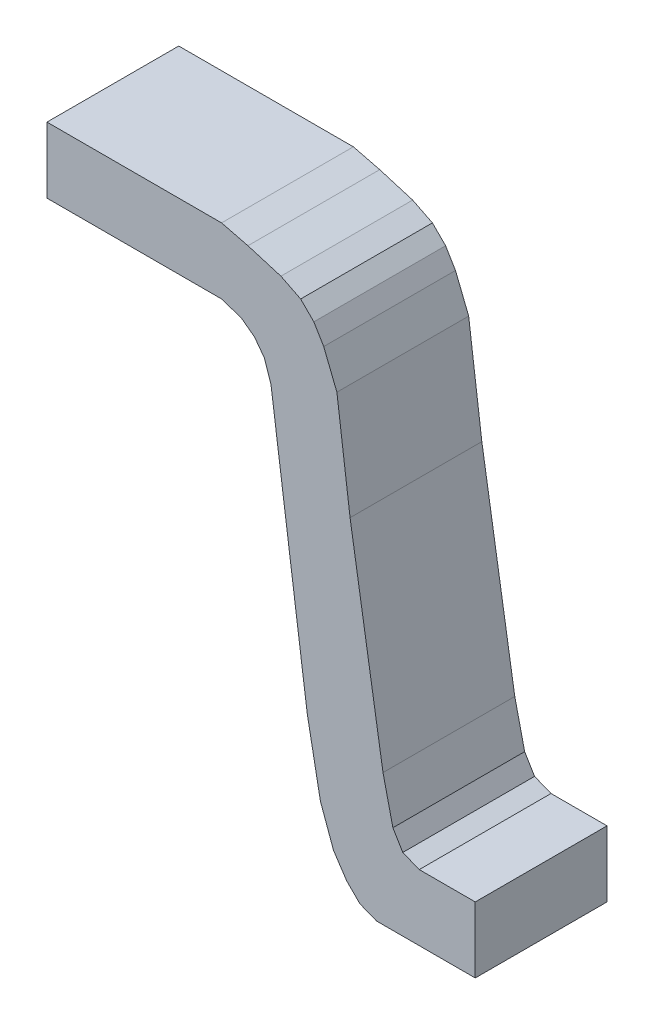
ISO-10303-21;
HEADER;
FILE_DESCRIPTION(('STEP AP214'),'2;1');
FILE_NAME('part.step','',(''),(''),'','','');
FILE_SCHEMA(('AUTOMOTIVE_DESIGN { 1 0 10303 214 1 1 1 1 }'));
ENDSEC;
DATA;
#1=APPLICATION_CONTEXT('core data for automotive mechanical design processes');
#2=APPLICATION_PROTOCOL_DEFINITION('international standard','automotive_design',2000,#1);
#3=PRODUCT_CONTEXT('',#1,'mechanical');
#4=PRODUCT('Part','Part','',(#3));
#5=PRODUCT_RELATED_PRODUCT_CATEGORY('part','',(#4));
#6=PRODUCT_DEFINITION_FORMATION('','',#4);
#7=PRODUCT_DEFINITION_CONTEXT('part definition',#1,'design');
#8=PRODUCT_DEFINITION('design','',#6,#7);
#9=PRODUCT_DEFINITION_SHAPE('','',#8);
#10=(LENGTH_UNIT() NAMED_UNIT(*) SI_UNIT(.MILLI.,.METRE.));
#11=(NAMED_UNIT(*) PLANE_ANGLE_UNIT() SI_UNIT($,.RADIAN.));
#12=(NAMED_UNIT(*) SI_UNIT($,.STERADIAN.) SOLID_ANGLE_UNIT());
#13=UNCERTAINTY_MEASURE_WITH_UNIT(LENGTH_MEASURE(1.E-05),#10,'distance_accuracy_value','');
#14=(GEOMETRIC_REPRESENTATION_CONTEXT(3) GLOBAL_UNCERTAINTY_ASSIGNED_CONTEXT((#13)) GLOBAL_UNIT_ASSIGNED_CONTEXT((#10,
#11,#12)) REPRESENTATION_CONTEXT('',''));
#15=CARTESIAN_POINT('',(0.,0.,0.));
#16=DIRECTION('',(0.,0.,1.));
#17=DIRECTION('',(1.,0.,0.));
#18=AXIS2_PLACEMENT_3D('',#15,#16,#17);
#19=CARTESIAN_POINT('',(0.65000124,-0.7999984,0.4));
#20=DIRECTION('',(0.,0.,1.));
#21=DIRECTION('',(1.,0.,0.));
#22=AXIS2_PLACEMENT_3D('',#19,#20,#21);
#23=PLANE('',#22);
#24=DIRECTION('',(0.928476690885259,-0.371390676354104,0.));
#25=VECTOR('',#24,1.);
#26=CARTESIAN_POINT('',(0.35000184,-0.7999984,0.4));
#27=LINE('',#26,#25);
#28=CARTESIAN_POINT('',(0.35000184,-0.7999984,0.4));
#29=VERTEX_POINT('',#28);
#30=CARTESIAN_POINT('',(0.30000194,-0.77999844,0.4));
#31=VERTEX_POINT('',#30);
#32=EDGE_CURVE('E307',#29,#31,#27,.F.);
#33=ORIENTED_EDGE('',*,*,#32,.F.);
#34=DIRECTION('',(1.,0.,0.));
#35=VECTOR('',#34,1.);
#36=CARTESIAN_POINT('',(0.65000124,-0.7999984,0.4));
#37=LINE('',#36,#35);
#38=CARTESIAN_POINT('',(0.65000124,-0.7999984,0.4));
#39=VERTEX_POINT('',#38);
#40=EDGE_CURVE('E208',#39,#29,#37,.F.);
#41=ORIENTED_EDGE('',*,*,#40,.F.);
#42=DIRECTION('',(0.,1.,0.));
#43=VECTOR('',#42,1.);
#44=CARTESIAN_POINT('',(0.65000124,-0.5999988,0.4));
#45=LINE('',#44,#43);
#46=CARTESIAN_POINT('',(0.65000124,-0.5999988,0.4));
#47=VERTEX_POINT('',#46);
#48=EDGE_CURVE('E20',#47,#39,#45,.F.);
#49=ORIENTED_EDGE('',*,*,#48,.F.);
#50=DIRECTION('',(1.,0.,0.));
#51=VECTOR('',#50,1.);
#52=CARTESIAN_POINT('',(0.48000158,-0.5999988,0.4));
#53=LINE('',#52,#51);
#54=CARTESIAN_POINT('',(0.48000158,-0.5999988,0.4));
#55=VERTEX_POINT('',#54);
#56=EDGE_CURVE('E197',#55,#47,#53,.T.);
#57=ORIENTED_EDGE('',*,*,#56,.F.);
#58=DIRECTION('',(-0.928476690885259,0.371390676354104,0.));
#59=VECTOR('',#58,1.);
#60=CARTESIAN_POINT('',(0.43000168,-0.57999884,0.4));
#61=LINE('',#60,#59);
#62=CARTESIAN_POINT('',(0.430001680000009,-0.579998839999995,0.4));
#63=VERTEX_POINT('',#62);
#64=EDGE_CURVE('E192',#63,#55,#61,.F.);
#65=ORIENTED_EDGE('',*,*,#64,.F.);
#66=DIRECTION('',(-0.514495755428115,0.857492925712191,0.));
#67=VECTOR('',#66,1.);
#68=CARTESIAN_POINT('',(0.40000174,-0.52999894,0.4));
#69=LINE('',#68,#67);
#70=CARTESIAN_POINT('',(0.400001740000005,-0.529998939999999,0.4));
#71=VERTEX_POINT('',#70);
#72=EDGE_CURVE('E219',#71,#63,#69,.F.);
#73=ORIENTED_EDGE('',*,*,#72,.F.);
#74=DIRECTION('',(-0.224859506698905,0.974391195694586,0.));
#75=VECTOR('',#74,1.);
#76=CARTESIAN_POINT('',(0.3700018,-0.3999992,0.4));
#77=LINE('',#76,#75);
#78=CARTESIAN_POINT('',(0.37000180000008,-0.399999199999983,0.4));
#79=VERTEX_POINT('',#78);
#80=EDGE_CURVE('E223',#79,#71,#77,.F.);
#81=ORIENTED_EDGE('',*,*,#80,.F.);
#82=DIRECTION('',(-0.159231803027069,0.987241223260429,0.));
#83=VECTOR('',#82,1.);
#84=CARTESIAN_POINT('',(0.270002,0.2200021,0.4));
#85=LINE('',#84,#83);
#86=CARTESIAN_POINT('',(0.270001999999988,0.220002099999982,0.4));
#87=VERTEX_POINT('',#86);
#88=EDGE_CURVE('E227',#87,#79,#85,.F.);
#89=ORIENTED_EDGE('',*,*,#88,.F.);
#90=DIRECTION('',(-0.127971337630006,0.99177786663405,0.));
#91=VECTOR('',#90,1.);
#92=CARTESIAN_POINT('',(0.23000208,0.53000148,0.4));
#93=LINE('',#92,#91);
#94=CARTESIAN_POINT('',(0.23000208,0.53000148,0.4));
#95=VERTEX_POINT('',#94);
#96=EDGE_CURVE('E231',#95,#87,#93,.F.);
#97=ORIENTED_EDGE('',*,*,#96,.F.);
#98=DIRECTION('',(-0.371390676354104,0.928476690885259,0.));
#99=VECTOR('',#98,1.);
#100=CARTESIAN_POINT('',(0.19000216,0.63000128,0.4));
#101=LINE('',#100,#99);
#102=CARTESIAN_POINT('',(0.190002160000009,0.630001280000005,0.4));
#103=VERTEX_POINT('',#102);
#104=EDGE_CURVE('E235',#103,#95,#101,.F.);
#105=ORIENTED_EDGE('',*,*,#104,.F.);
#106=DIRECTION('',(-0.514495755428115,0.857492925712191,0.));
#107=VECTOR('',#106,1.);
#108=CARTESIAN_POINT('',(0.16000222,0.68000118,0.4));
#109=LINE('',#108,#107);
#110=CARTESIAN_POINT('',(0.16000222,0.68000118,0.4));
#111=VERTEX_POINT('',#110);
#112=EDGE_CURVE('E239',#111,#103,#109,.F.);
#113=ORIENTED_EDGE('',*,*,#112,.F.);
#114=DIRECTION('',(-0.707106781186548,0.707106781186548,0.));
#115=VECTOR('',#114,1.);
#116=CARTESIAN_POINT('',(0.1200023,0.7200011,0.4));
#117=LINE('',#116,#115);
#118=CARTESIAN_POINT('',(0.1200023,0.7200011,0.4));
#119=VERTEX_POINT('',#118);
#120=EDGE_CURVE('E243',#119,#111,#117,.F.);
#121=ORIENTED_EDGE('',*,*,#120,.F.);
#122=DIRECTION('',(-0.894427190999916,0.447213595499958,0.));
#123=VECTOR('',#122,1.);
#124=CARTESIAN_POINT('',(0.06000242,0.75000104,0.4));
#125=LINE('',#124,#123);
#126=CARTESIAN_POINT('',(0.0600024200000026,0.750001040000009,0.4));
#127=VERTEX_POINT('',#126);
#128=EDGE_CURVE('E247',#127,#119,#125,.F.);
#129=ORIENTED_EDGE('',*,*,#128,.F.);
#130=DIRECTION('',(-0.957828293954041,0.287341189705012,0.));
#131=VECTOR('',#130,1.);
#132=CARTESIAN_POINT('',(-0.03999992,0.78000098,0.4));
#133=LINE('',#132,#131);
#134=CARTESIAN_POINT('',(-0.0399999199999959,0.780000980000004,0.4));
#135=VERTEX_POINT('',#134);
#136=EDGE_CURVE('E251',#135,#127,#133,.F.);
#137=ORIENTED_EDGE('',*,*,#136,.F.);
#138=DIRECTION('',(-0.970142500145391,0.242535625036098,0.));
#139=VECTOR('',#138,1.);
#140=CARTESIAN_POINT('',(-0.11999976,0.80000094,0.4));
#141=LINE('',#140,#139);
#142=CARTESIAN_POINT('',(-0.11999976,0.80000094,0.4));
#143=VERTEX_POINT('',#142);
#144=EDGE_CURVE('E255',#143,#135,#141,.F.);
#145=ORIENTED_EDGE('',*,*,#144,.F.);
#146=DIRECTION('',(1.,0.,0.));
#147=VECTOR('',#146,1.);
#148=CARTESIAN_POINT('',(-0.6499987,0.80000094,0.4));
#149=LINE('',#148,#147);
#150=CARTESIAN_POINT('',(-0.6499987,0.80000094,0.4));
#151=VERTEX_POINT('',#150);
#152=EDGE_CURVE('E259',#151,#143,#149,.T.);
#153=ORIENTED_EDGE('',*,*,#152,.F.);
#154=DIRECTION('',(0.,1.,0.));
#155=VECTOR('',#154,1.);
#156=CARTESIAN_POINT('',(-0.6499987,0.60000134,0.4));
#157=LINE('',#156,#155);
#158=CARTESIAN_POINT('',(-0.6499987,0.60000134,0.4));
#159=VERTEX_POINT('',#158);
#160=EDGE_CURVE('E263',#159,#151,#157,.T.);
#161=ORIENTED_EDGE('',*,*,#160,.F.);
#162=DIRECTION('',(1.,0.,0.));
#163=VECTOR('',#162,1.);
#164=CARTESIAN_POINT('',(-0.11999976,0.60000134,0.4));
#165=LINE('',#164,#163);
#166=CARTESIAN_POINT('',(-0.11999976,0.60000134,0.4));
#167=VERTEX_POINT('',#166);
#168=EDGE_CURVE('E267',#167,#159,#165,.F.);
#169=ORIENTED_EDGE('',*,*,#168,.F.);
#170=DIRECTION('',(0.948683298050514,-0.316227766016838,0.));
#171=VECTOR('',#170,1.);
#172=CARTESIAN_POINT('',(-0.05999988,0.58000138,0.4));
#173=LINE('',#172,#171);
#174=CARTESIAN_POINT('',(-0.05999988,0.58000138,0.4));
#175=VERTEX_POINT('',#174);
#176=EDGE_CURVE('E271',#175,#167,#173,.F.);
#177=ORIENTED_EDGE('',*,*,#176,.F.);
#178=DIRECTION('',(0.8,-0.6,0.));
#179=VECTOR('',#178,1.);
#180=CARTESIAN_POINT('',(-0.01999996,0.55000144,0.4));
#181=LINE('',#180,#179);
#182=CARTESIAN_POINT('',(-0.01999996,0.55000144,0.4));
#183=VERTEX_POINT('',#182);
#184=EDGE_CURVE('E275',#183,#175,#181,.F.);
#185=ORIENTED_EDGE('',*,*,#184,.F.);
#186=DIRECTION('',(0.6,-0.8,0.));
#187=VECTOR('',#186,1.);
#188=CARTESIAN_POINT('',(0.00999998,0.51000152,0.4));
#189=LINE('',#188,#187);
#190=CARTESIAN_POINT('',(0.00999998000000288,0.510001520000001,0.4));
#191=VERTEX_POINT('',#190);
#192=EDGE_CURVE('E279',#191,#183,#189,.F.);
#193=ORIENTED_EDGE('',*,*,#192,.F.);
#194=DIRECTION('',(0.316263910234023,-0.948671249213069,0.));
#195=VECTOR('',#194,1.);
#196=CARTESIAN_POINT('',(0.03000248,0.45000164,0.4));
#197=LINE('',#196,#195);
#198=CARTESIAN_POINT('',(0.0300024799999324,0.450001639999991,0.4));
#199=VERTEX_POINT('',#198);
#200=EDGE_CURVE('E283',#199,#191,#197,.F.);
#201=ORIENTED_EDGE('',*,*,#200,.F.);
#202=DIRECTION('',(0.134566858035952,-0.990904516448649,0.));
#203=VECTOR('',#202,1.);
#204=CARTESIAN_POINT('',(0.14000226,-0.35999928,0.4));
#205=LINE('',#204,#203);
#206=CARTESIAN_POINT('',(0.140002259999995,-0.359999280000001,0.4));
#207=VERTEX_POINT('',#206);
#208=EDGE_CURVE('E287',#207,#199,#205,.F.);
#209=ORIENTED_EDGE('',*,*,#208,.F.);
#210=DIRECTION('',(0.187112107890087,-0.982338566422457,0.));
#211=VECTOR('',#210,1.);
#212=CARTESIAN_POINT('',(0.18000218,-0.56999886,0.4));
#213=LINE('',#212,#211);
#214=CARTESIAN_POINT('',(0.180002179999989,-0.569998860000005,0.4));
#215=VERTEX_POINT('',#214);
#216=EDGE_CURVE('E291',#215,#207,#213,.F.);
#217=ORIENTED_EDGE('',*,*,#216,.F.);
#218=DIRECTION('',(0.341743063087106,-0.939793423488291,0.));
#219=VECTOR('',#218,1.);
#220=CARTESIAN_POINT('',(0.2200021,-0.67999864,0.4));
#221=LINE('',#220,#219);
#222=CARTESIAN_POINT('',(0.220002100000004,-0.679998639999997,0.4));
#223=VERTEX_POINT('',#222);
#224=EDGE_CURVE('E295',#223,#215,#221,.F.);
#225=ORIENTED_EDGE('',*,*,#224,.F.);
#226=DIRECTION('',(0.554700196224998,-0.832050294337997,0.));
#227=VECTOR('',#226,1.);
#228=CARTESIAN_POINT('',(0.26000202,-0.73999852,0.4));
#229=LINE('',#228,#227);
#230=CARTESIAN_POINT('',(0.26000202,-0.73999852,0.4));
#231=VERTEX_POINT('',#230);
#232=EDGE_CURVE('E299',#231,#223,#229,.F.);
#233=ORIENTED_EDGE('',*,*,#232,.F.);
#234=DIRECTION('',(0.707106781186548,-0.707106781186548,0.));
#235=VECTOR('',#234,1.);
#236=CARTESIAN_POINT('',(0.30000194,-0.77999844,0.4));
#237=LINE('',#236,#235);
#238=EDGE_CURVE('E303',#31,#231,#237,.F.);
#239=ORIENTED_EDGE('',*,*,#238,.F.);
#240=EDGE_LOOP('',(#33,#41,#49,#57,#65,#73,#81,#89,#97,#105,#113,#121,#129,#137,#145,#153,#161,
#169,#177,#185,#193,#201,#209,#217,#225,#233,#239));
#241=FACE_BOUND('',#240,.T.);
#242=ADVANCED_FACE('F17',(#241),#23,.T.);
#243=CARTESIAN_POINT('',(0.65000124,-0.5999988,0.));
#244=DIRECTION('',(1.,0.,0.));
#245=DIRECTION('',(0.,0.,-1.));
#246=AXIS2_PLACEMENT_3D('',#243,#244,#245);
#247=PLANE('',#246);
#248=DIRECTION('',(0.,0.,-1.));
#249=VECTOR('',#248,1.);
#250=CARTESIAN_POINT('',(0.65000124,-0.7999984,0.));
#251=LINE('',#250,#249);
#252=CARTESIAN_POINT('',(0.65000124,-0.7999984,0.));
#253=VERTEX_POINT('',#252);
#254=EDGE_CURVE('E311',#253,#39,#251,.F.);
#255=ORIENTED_EDGE('',*,*,#254,.F.);
#256=DIRECTION('',(0.,1.,0.));
#257=VECTOR('',#256,1.);
#258=CARTESIAN_POINT('',(0.65000124,-0.7999984,0.));
#259=LINE('',#258,#257);
#260=CARTESIAN_POINT('',(0.65000124,-0.5999988,0.));
#261=VERTEX_POINT('',#260);
#262=EDGE_CURVE('E214',#253,#261,#259,.T.);
#263=ORIENTED_EDGE('',*,*,#262,.T.);
#264=DIRECTION('',(0.,0.,1.));
#265=VECTOR('',#264,1.);
#266=CARTESIAN_POINT('',(0.65000124,-0.5999988,0.));
#267=LINE('',#266,#265);
#268=EDGE_CURVE('E202',#47,#261,#267,.F.);
#269=ORIENTED_EDGE('',*,*,#268,.F.);
#270=ORIENTED_EDGE('',*,*,#48,.T.);
#271=EDGE_LOOP('',(#255,#263,#269,#270));
#272=FACE_BOUND('',#271,.T.);
#273=ADVANCED_FACE('F213',(#272),#247,.T.);
#274=CARTESIAN_POINT('',(0.48000158,-0.5999988,0.));
#275=DIRECTION('',(0.,1.,0.));
#276=DIRECTION('',(0.,0.,1.));
#277=AXIS2_PLACEMENT_3D('',#274,#275,#276);
#278=PLANE('',#277);
#279=ORIENTED_EDGE('',*,*,#268,.T.);
#280=DIRECTION('',(1.,0.,0.));
#281=VECTOR('',#280,1.);
#282=CARTESIAN_POINT('',(0.65000124,-0.5999988,0.));
#283=LINE('',#282,#281);
#284=CARTESIAN_POINT('',(0.48000158,-0.5999988,0.));
#285=VERTEX_POINT('',#284);
#286=EDGE_CURVE('E316',#261,#285,#283,.F.);
#287=ORIENTED_EDGE('',*,*,#286,.T.);
#288=DIRECTION('',(0.,0.,1.));
#289=VECTOR('',#288,1.);
#290=CARTESIAN_POINT('',(0.48000158,-0.5999988,0.));
#291=LINE('',#290,#289);
#292=EDGE_CURVE('E204',#55,#285,#291,.F.);
#293=ORIENTED_EDGE('',*,*,#292,.F.);
#294=ORIENTED_EDGE('',*,*,#56,.T.);
#295=EDGE_LOOP('',(#279,#287,#293,#294));
#296=FACE_BOUND('',#295,.T.);
#297=ADVANCED_FACE('F199',(#296),#278,.T.);
#298=CARTESIAN_POINT('',(0.43000168,-0.57999884,0.));
#299=DIRECTION('',(0.371390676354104,0.928476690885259,0.));
#300=DIRECTION('',(-0.928476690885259,0.371390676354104,0.));
#301=AXIS2_PLACEMENT_3D('',#298,#299,#300);
#302=PLANE('',#301);
#303=ORIENTED_EDGE('',*,*,#292,.T.);
#304=DIRECTION('',(-0.928476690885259,0.371390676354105,0.));
#305=VECTOR('',#304,1.);
#306=CARTESIAN_POINT('',(0.48000158,-0.5999988,0.));
#307=LINE('',#306,#305);
#308=CARTESIAN_POINT('',(0.430001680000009,-0.579998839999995,0.));
#309=VERTEX_POINT('',#308);
#310=EDGE_CURVE('E318',#285,#309,#307,.T.);
#311=ORIENTED_EDGE('',*,*,#310,.T.);
#312=DIRECTION('',(0.,0.,1.));
#313=VECTOR('',#312,1.);
#314=CARTESIAN_POINT('',(0.430001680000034,-0.579998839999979,0.));
#315=LINE('',#314,#313);
#316=EDGE_CURVE('E221',#63,#309,#315,.F.);
#317=ORIENTED_EDGE('',*,*,#316,.F.);
#318=ORIENTED_EDGE('',*,*,#64,.T.);
#319=EDGE_LOOP('',(#303,#311,#317,#318));
#320=FACE_BOUND('',#319,.T.);
#321=ADVANCED_FACE('F504',(#320),#302,.T.);
#322=CARTESIAN_POINT('',(0.40000174,-0.52999894,0.));
#323=DIRECTION('',(0.857492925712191,0.514495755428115,0.));
#324=DIRECTION('',(-0.514495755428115,0.857492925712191,0.));
#325=AXIS2_PLACEMENT_3D('',#322,#323,#324);
#326=PLANE('',#325);
#327=ORIENTED_EDGE('',*,*,#316,.T.);
#328=DIRECTION('',(-0.514495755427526,0.857492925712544,0.));
#329=VECTOR('',#328,1.);
#330=CARTESIAN_POINT('',(0.43000168,-0.57999884,0.));
#331=LINE('',#330,#329);
#332=CARTESIAN_POINT('',(0.400001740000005,-0.529998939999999,0.));
#333=VERTEX_POINT('',#332);
#334=EDGE_CURVE('E321',#309,#333,#331,.T.);
#335=ORIENTED_EDGE('',*,*,#334,.T.);
#336=DIRECTION('',(0.,0.,1.));
#337=VECTOR('',#336,1.);
#338=CARTESIAN_POINT('',(0.40000174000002,-0.529998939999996,0.));
#339=LINE('',#338,#337);
#340=EDGE_CURVE('E225',#71,#333,#339,.F.);
#341=ORIENTED_EDGE('',*,*,#340,.F.);
#342=ORIENTED_EDGE('',*,*,#72,.T.);
#343=EDGE_LOOP('',(#327,#335,#341,#342));
#344=FACE_BOUND('',#343,.T.);
#345=ADVANCED_FACE('F502',(#344),#326,.T.);
#346=CARTESIAN_POINT('',(0.3700018,-0.3999992,0.));
#347=DIRECTION('',(0.974391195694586,0.224859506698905,0.));
#348=DIRECTION('',(-0.224859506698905,0.974391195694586,0.));
#349=AXIS2_PLACEMENT_3D('',#346,#347,#348);
#350=PLANE('',#349);
#351=ORIENTED_EDGE('',*,*,#340,.T.);
#352=DIRECTION('',(-0.224859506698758,0.97439119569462,0.));
#353=VECTOR('',#352,1.);
#354=CARTESIAN_POINT('',(0.40000174,-0.52999894,0.));
#355=LINE('',#354,#353);
#356=CARTESIAN_POINT('',(0.370001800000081,-0.399999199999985,0.));
#357=VERTEX_POINT('',#356);
#358=EDGE_CURVE('E324',#333,#357,#355,.T.);
#359=ORIENTED_EDGE('',*,*,#358,.T.);
#360=DIRECTION('',(0.,0.,1.));
#361=VECTOR('',#360,1.);
#362=CARTESIAN_POINT('',(0.370001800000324,-0.399999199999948,0.));
#363=LINE('',#362,#361);
#364=EDGE_CURVE('E229',#79,#357,#363,.F.);
#365=ORIENTED_EDGE('',*,*,#364,.F.);
#366=ORIENTED_EDGE('',*,*,#80,.T.);
#367=EDGE_LOOP('',(#351,#359,#365,#366));
#368=FACE_BOUND('',#367,.T.);
#369=ADVANCED_FACE('F498',(#368),#350,.T.);
#370=CARTESIAN_POINT('',(0.270002,0.2200021,0.));
#371=DIRECTION('',(0.987241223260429,0.159231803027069,0.));
#372=DIRECTION('',(-0.159231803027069,0.987241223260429,0.));
#373=AXIS2_PLACEMENT_3D('',#370,#371,#372);
#374=PLANE('',#373);
#375=ORIENTED_EDGE('',*,*,#364,.T.);
#376=DIRECTION('',(-0.159231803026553,0.987241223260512,0.));
#377=VECTOR('',#376,1.);
#378=CARTESIAN_POINT('',(0.3700018,-0.3999992,0.));
#379=LINE('',#378,#377);
#380=CARTESIAN_POINT('',(0.270001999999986,0.22000209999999,0.));
#381=VERTEX_POINT('',#380);
#382=EDGE_CURVE('E327',#357,#381,#379,.T.);
#383=ORIENTED_EDGE('',*,*,#382,.T.);
#384=DIRECTION('',(0.,0.,1.));
#385=VECTOR('',#384,1.);
#386=CARTESIAN_POINT('',(0.27000199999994,0.220002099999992,0.));
#387=LINE('',#386,#385);
#388=EDGE_CURVE('E233',#87,#381,#387,.F.);
#389=ORIENTED_EDGE('',*,*,#388,.F.);
#390=ORIENTED_EDGE('',*,*,#88,.T.);
#391=EDGE_LOOP('',(#375,#383,#389,#390));
#392=FACE_BOUND('',#391,.T.);
#393=ADVANCED_FACE('F492',(#392),#374,.T.);
#394=CARTESIAN_POINT('',(0.23000208,0.53000148,0.));
#395=DIRECTION('',(0.99177786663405,0.127971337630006,0.));
#396=DIRECTION('',(-0.127971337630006,0.99177786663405,0.));
#397=AXIS2_PLACEMENT_3D('',#394,#395,#396);
#398=PLANE('',#397);
#399=ORIENTED_EDGE('',*,*,#388,.T.);
#400=DIRECTION('',(-0.127971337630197,0.991777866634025,0.));
#401=VECTOR('',#400,1.);
#402=CARTESIAN_POINT('',(0.270002,0.2200021,0.));
#403=LINE('',#402,#401);
#404=CARTESIAN_POINT('',(0.23000208,0.53000148,0.));
#405=VERTEX_POINT('',#404);
#406=EDGE_CURVE('E330',#381,#405,#403,.T.);
#407=ORIENTED_EDGE('',*,*,#406,.T.);
#408=DIRECTION('',(0.,0.,1.));
#409=VECTOR('',#408,1.);
#410=CARTESIAN_POINT('',(0.23000208,0.53000148,0.));
#411=LINE('',#410,#409);
#412=EDGE_CURVE('E237',#95,#405,#411,.F.);
#413=ORIENTED_EDGE('',*,*,#412,.F.);
#414=ORIENTED_EDGE('',*,*,#96,.T.);
#415=EDGE_LOOP('',(#399,#407,#413,#414));
#416=FACE_BOUND('',#415,.T.);
#417=ADVANCED_FACE('F488',(#416),#398,.T.);
#418=CARTESIAN_POINT('',(0.19000216,0.63000128,0.));
#419=DIRECTION('',(0.928476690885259,0.371390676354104,0.));
#420=DIRECTION('',(-0.371390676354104,0.928476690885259,0.));
#421=AXIS2_PLACEMENT_3D('',#418,#419,#420);
#422=PLANE('',#421);
#423=ORIENTED_EDGE('',*,*,#412,.T.);
#424=DIRECTION('',(-0.371390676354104,0.928476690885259,0.));
#425=VECTOR('',#424,1.);
#426=CARTESIAN_POINT('',(0.23000208,0.53000148,0.));
#427=LINE('',#426,#425);
#428=CARTESIAN_POINT('',(0.190002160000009,0.630001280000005,0.));
#429=VERTEX_POINT('',#428);
#430=EDGE_CURVE('E333',#405,#429,#427,.T.);
#431=ORIENTED_EDGE('',*,*,#430,.T.);
#432=DIRECTION('',(0.,0.,1.));
#433=VECTOR('',#432,1.);
#434=CARTESIAN_POINT('',(0.190002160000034,0.630001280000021,0.));
#435=LINE('',#434,#433);
#436=EDGE_CURVE('E241',#103,#429,#435,.F.);
#437=ORIENTED_EDGE('',*,*,#436,.F.);
#438=ORIENTED_EDGE('',*,*,#104,.T.);
#439=EDGE_LOOP('',(#423,#431,#437,#438));
#440=FACE_BOUND('',#439,.T.);
#441=ADVANCED_FACE('F482',(#440),#422,.T.);
#442=CARTESIAN_POINT('',(0.16000222,0.68000118,0.));
#443=DIRECTION('',(0.857492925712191,0.514495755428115,0.));
#444=DIRECTION('',(-0.514495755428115,0.857492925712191,0.));
#445=AXIS2_PLACEMENT_3D('',#442,#443,#444);
#446=PLANE('',#445);
#447=ORIENTED_EDGE('',*,*,#436,.T.);
#448=DIRECTION('',(-0.514495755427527,0.857492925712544,0.));
#449=VECTOR('',#448,1.);
#450=CARTESIAN_POINT('',(0.19000216,0.63000128,0.));
#451=LINE('',#450,#449);
#452=CARTESIAN_POINT('',(0.16000222,0.68000118,0.));
#453=VERTEX_POINT('',#452);
#454=EDGE_CURVE('E336',#429,#453,#451,.T.);
#455=ORIENTED_EDGE('',*,*,#454,.T.);
#456=DIRECTION('',(0.,0.,1.));
#457=VECTOR('',#456,1.);
#458=CARTESIAN_POINT('',(0.16000222,0.68000118,0.));
#459=LINE('',#458,#457);
#460=EDGE_CURVE('E245',#111,#453,#459,.F.);
#461=ORIENTED_EDGE('',*,*,#460,.F.);
#462=ORIENTED_EDGE('',*,*,#112,.T.);
#463=EDGE_LOOP('',(#447,#455,#461,#462));
#464=FACE_BOUND('',#463,.T.);
#465=ADVANCED_FACE('F478',(#464),#446,.T.);
#466=CARTESIAN_POINT('',(0.1200023,0.7200011,0.));
#467=DIRECTION('',(0.707106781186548,0.707106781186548,0.));
#468=DIRECTION('',(-0.707106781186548,0.707106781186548,0.));
#469=AXIS2_PLACEMENT_3D('',#466,#467,#468);
#470=PLANE('',#469);
#471=ORIENTED_EDGE('',*,*,#460,.T.);
#472=DIRECTION('',(-0.707106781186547,0.707106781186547,0.));
#473=VECTOR('',#472,1.);
#474=CARTESIAN_POINT('',(0.16000222,0.68000118,0.));
#475=LINE('',#474,#473);
#476=CARTESIAN_POINT('',(0.1200023,0.7200011,0.));
#477=VERTEX_POINT('',#476);
#478=EDGE_CURVE('E339',#453,#477,#475,.T.);
#479=ORIENTED_EDGE('',*,*,#478,.T.);
#480=DIRECTION('',(0.,0.,1.));
#481=VECTOR('',#480,1.);
#482=CARTESIAN_POINT('',(0.1200023,0.7200011,0.));
#483=LINE('',#482,#481);
#484=EDGE_CURVE('E249',#119,#477,#483,.F.);
#485=ORIENTED_EDGE('',*,*,#484,.F.);
#486=ORIENTED_EDGE('',*,*,#120,.T.);
#487=EDGE_LOOP('',(#471,#479,#485,#486));
#488=FACE_BOUND('',#487,.T.);
#489=ADVANCED_FACE('F472',(#488),#470,.T.);
#490=CARTESIAN_POINT('',(0.06000242,0.75000104,0.));
#491=DIRECTION('',(0.447213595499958,0.894427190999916,0.));
#492=DIRECTION('',(-0.894427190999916,0.447213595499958,0.));
#493=AXIS2_PLACEMENT_3D('',#490,#491,#492);
#494=PLANE('',#493);
#495=ORIENTED_EDGE('',*,*,#484,.T.);
#496=DIRECTION('',(-0.894427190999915,0.447213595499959,0.));
#497=VECTOR('',#496,1.);
#498=CARTESIAN_POINT('',(0.1200023,0.7200011,0.));
#499=LINE('',#498,#497);
#500=CARTESIAN_POINT('',(0.0600024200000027,0.750001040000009,0.));
#501=VERTEX_POINT('',#500);
#502=EDGE_CURVE('E342',#477,#501,#499,.T.);
#503=ORIENTED_EDGE('',*,*,#502,.T.);
#504=DIRECTION('',(0.,0.,1.));
#505=VECTOR('',#504,1.);
#506=CARTESIAN_POINT('',(0.060002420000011,0.750001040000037,0.));
#507=LINE('',#506,#505);
#508=EDGE_CURVE('E253',#127,#501,#507,.F.);
#509=ORIENTED_EDGE('',*,*,#508,.F.);
#510=ORIENTED_EDGE('',*,*,#128,.T.);
#511=EDGE_LOOP('',(#495,#503,#509,#510));
#512=FACE_BOUND('',#511,.T.);
#513=ADVANCED_FACE('F468',(#512),#494,.T.);
#514=CARTESIAN_POINT('',(-0.03999992,0.78000098,0.));
#515=DIRECTION('',(0.287341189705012,0.957828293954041,0.));
#516=DIRECTION('',(-0.957828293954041,0.287341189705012,0.));
#517=AXIS2_PLACEMENT_3D('',#514,#515,#516);
#518=PLANE('',#517);
#519=ORIENTED_EDGE('',*,*,#508,.T.);
#520=DIRECTION('',(-0.957828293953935,0.287341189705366,0.));
#521=VECTOR('',#520,1.);
#522=CARTESIAN_POINT('',(0.06000242,0.75000104,0.));
#523=LINE('',#522,#521);
#524=CARTESIAN_POINT('',(-0.0399999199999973,0.780000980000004,0.));
#525=VERTEX_POINT('',#524);
#526=EDGE_CURVE('E345',#501,#525,#523,.T.);
#527=ORIENTED_EDGE('',*,*,#526,.T.);
#528=DIRECTION('',(0.,0.,1.));
#529=VECTOR('',#528,1.);
#530=CARTESIAN_POINT('',(-0.0399999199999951,0.780000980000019,0.));
#531=LINE('',#530,#529);
#532=EDGE_CURVE('E257',#135,#525,#531,.F.);
#533=ORIENTED_EDGE('',*,*,#532,.F.);
#534=ORIENTED_EDGE('',*,*,#136,.T.);
#535=EDGE_LOOP('',(#519,#527,#533,#534));
#536=FACE_BOUND('',#535,.T.);
#537=ADVANCED_FACE('F462',(#536),#518,.T.);
#538=CARTESIAN_POINT('',(-0.11999976,0.80000094,0.));
#539=DIRECTION('',(0.242535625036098,0.970142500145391,0.));
#540=DIRECTION('',(-0.970142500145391,0.242535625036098,0.));
#541=AXIS2_PLACEMENT_3D('',#538,#539,#540);
#542=PLANE('',#541);
#543=ORIENTED_EDGE('',*,*,#532,.T.);
#544=DIRECTION('',(-0.970142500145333,0.24253562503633,0.));
#545=VECTOR('',#544,1.);
#546=CARTESIAN_POINT('',(-0.03999992,0.78000098,0.));
#547=LINE('',#546,#545);
#548=CARTESIAN_POINT('',(-0.11999976,0.80000094,0.));
#549=VERTEX_POINT('',#548);
#550=EDGE_CURVE('E348',#525,#549,#547,.T.);
#551=ORIENTED_EDGE('',*,*,#550,.T.);
#552=DIRECTION('',(0.,0.,1.));
#553=VECTOR('',#552,1.);
#554=CARTESIAN_POINT('',(-0.11999976,0.80000094,0.));
#555=LINE('',#554,#553);
#556=EDGE_CURVE('E261',#143,#549,#555,.F.);
#557=ORIENTED_EDGE('',*,*,#556,.F.);
#558=ORIENTED_EDGE('',*,*,#144,.T.);
#559=EDGE_LOOP('',(#543,#551,#557,#558));
#560=FACE_BOUND('',#559,.T.);
#561=ADVANCED_FACE('F458',(#560),#542,.T.);
#562=CARTESIAN_POINT('',(-0.6499987,0.80000094,0.));
#563=DIRECTION('',(0.,1.,0.));
#564=DIRECTION('',(0.,0.,1.));
#565=AXIS2_PLACEMENT_3D('',#562,#563,#564);
#566=PLANE('',#565);
#567=ORIENTED_EDGE('',*,*,#556,.T.);
#568=DIRECTION('',(1.,0.,0.));
#569=VECTOR('',#568,1.);
#570=CARTESIAN_POINT('',(0.65000124,0.80000094,0.));
#571=LINE('',#570,#569);
#572=CARTESIAN_POINT('',(-0.6499987,0.80000094,0.));
#573=VERTEX_POINT('',#572);
#574=EDGE_CURVE('E351',#549,#573,#571,.F.);
#575=ORIENTED_EDGE('',*,*,#574,.T.);
#576=DIRECTION('',(0.,0.,1.));
#577=VECTOR('',#576,1.);
#578=CARTESIAN_POINT('',(-0.6499987,0.80000094,0.));
#579=LINE('',#578,#577);
#580=EDGE_CURVE('E265',#151,#573,#579,.F.);
#581=ORIENTED_EDGE('',*,*,#580,.F.);
#582=ORIENTED_EDGE('',*,*,#152,.T.);
#583=EDGE_LOOP('',(#567,#575,#581,#582));
#584=FACE_BOUND('',#583,.T.);
#585=ADVANCED_FACE('F452',(#584),#566,.T.);
#586=CARTESIAN_POINT('',(-0.6499987,0.60000134,0.));
#587=DIRECTION('',(-1.,0.,0.));
#588=DIRECTION('',(0.,0.,1.));
#589=AXIS2_PLACEMENT_3D('',#586,#587,#588);
#590=PLANE('',#589);
#591=ORIENTED_EDGE('',*,*,#580,.T.);
#592=DIRECTION('',(0.,1.,0.));
#593=VECTOR('',#592,1.);
#594=CARTESIAN_POINT('',(-0.6499987,-0.7999984,0.));
#595=LINE('',#594,#593);
#596=CARTESIAN_POINT('',(-0.6499987,0.60000134,0.));
#597=VERTEX_POINT('',#596);
#598=EDGE_CURVE('E354',#573,#597,#595,.F.);
#599=ORIENTED_EDGE('',*,*,#598,.T.);
#600=DIRECTION('',(0.,0.,-1.));
#601=VECTOR('',#600,1.);
#602=CARTESIAN_POINT('',(-0.6499987,0.60000134,0.));
#603=LINE('',#602,#601);
#604=EDGE_CURVE('E269',#159,#597,#603,.T.);
#605=ORIENTED_EDGE('',*,*,#604,.F.);
#606=ORIENTED_EDGE('',*,*,#160,.T.);
#607=EDGE_LOOP('',(#591,#599,#605,#606));
#608=FACE_BOUND('',#607,.T.);
#609=ADVANCED_FACE('F448',(#608),#590,.T.);
#610=CARTESIAN_POINT('',(-0.11999976,0.60000134,0.));
#611=DIRECTION('',(0.,-1.,0.));
#612=DIRECTION('',(0.,0.,-1.));
#613=AXIS2_PLACEMENT_3D('',#610,#611,#612);
#614=PLANE('',#613);
#615=ORIENTED_EDGE('',*,*,#604,.T.);
#616=DIRECTION('',(1.,0.,0.));
#617=VECTOR('',#616,1.);
#618=CARTESIAN_POINT('',(0.65000124,0.60000134,0.));
#619=LINE('',#618,#617);
#620=CARTESIAN_POINT('',(-0.11999976,0.60000134,0.));
#621=VERTEX_POINT('',#620);
#622=EDGE_CURVE('E357',#597,#621,#619,.T.);
#623=ORIENTED_EDGE('',*,*,#622,.T.);
#624=DIRECTION('',(0.,0.,1.));
#625=VECTOR('',#624,1.);
#626=CARTESIAN_POINT('',(-0.11999976,0.60000134,0.));
#627=LINE('',#626,#625);
#628=EDGE_CURVE('E273',#167,#621,#627,.F.);
#629=ORIENTED_EDGE('',*,*,#628,.F.);
#630=ORIENTED_EDGE('',*,*,#168,.T.);
#631=EDGE_LOOP('',(#615,#623,#629,#630));
#632=FACE_BOUND('',#631,.T.);
#633=ADVANCED_FACE('F442',(#632),#614,.T.);
#634=CARTESIAN_POINT('',(-0.05999988,0.58000138,0.));
#635=DIRECTION('',(-0.316227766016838,-0.948683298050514,0.));
#636=DIRECTION('',(0.948683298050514,-0.316227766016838,0.));
#637=AXIS2_PLACEMENT_3D('',#634,#635,#636);
#638=PLANE('',#637);
#639=ORIENTED_EDGE('',*,*,#628,.T.);
#640=DIRECTION('',(0.948683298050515,-0.316227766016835,0.));
#641=VECTOR('',#640,1.);
#642=CARTESIAN_POINT('',(-0.11999976,0.60000134,0.));
#643=LINE('',#642,#641);
#644=CARTESIAN_POINT('',(-0.05999988,0.58000138,0.));
#645=VERTEX_POINT('',#644);
#646=EDGE_CURVE('E360',#621,#645,#643,.T.);
#647=ORIENTED_EDGE('',*,*,#646,.T.);
#648=DIRECTION('',(0.,0.,1.));
#649=VECTOR('',#648,1.);
#650=CARTESIAN_POINT('',(-0.05999988,0.58000138,0.));
#651=LINE('',#650,#649);
#652=EDGE_CURVE('E277',#175,#645,#651,.F.);
#653=ORIENTED_EDGE('',*,*,#652,.F.);
#654=ORIENTED_EDGE('',*,*,#176,.T.);
#655=EDGE_LOOP('',(#639,#647,#653,#654));
#656=FACE_BOUND('',#655,.T.);
#657=ADVANCED_FACE('F438',(#656),#638,.T.);
#658=CARTESIAN_POINT('',(-0.01999996,0.55000144,0.));
#659=DIRECTION('',(-0.6,-0.8,0.));
#660=DIRECTION('',(0.8,-0.6,0.));
#661=AXIS2_PLACEMENT_3D('',#658,#659,#660);
#662=PLANE('',#661);
#663=ORIENTED_EDGE('',*,*,#652,.T.);
#664=DIRECTION('',(0.799999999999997,-0.600000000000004,0.));
#665=VECTOR('',#664,1.);
#666=CARTESIAN_POINT('',(-0.05999988,0.58000138,0.));
#667=LINE('',#666,#665);
#668=CARTESIAN_POINT('',(-0.01999996,0.55000144,0.));
#669=VERTEX_POINT('',#668);
#670=EDGE_CURVE('E363',#645,#669,#667,.T.);
#671=ORIENTED_EDGE('',*,*,#670,.T.);
#672=DIRECTION('',(0.,0.,1.));
#673=VECTOR('',#672,1.);
#674=CARTESIAN_POINT('',(-0.0199999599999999,0.55000144,0.));
#675=LINE('',#674,#673);
#676=EDGE_CURVE('E281',#183,#669,#675,.F.);
#677=ORIENTED_EDGE('',*,*,#676,.F.);
#678=ORIENTED_EDGE('',*,*,#184,.T.);
#679=EDGE_LOOP('',(#663,#671,#677,#678));
#680=FACE_BOUND('',#679,.T.);
#681=ADVANCED_FACE('F432',(#680),#662,.T.);
#682=CARTESIAN_POINT('',(0.00999998,0.51000152,0.));
#683=DIRECTION('',(-0.8,-0.6,0.));
#684=DIRECTION('',(0.6,-0.8,0.));
#685=AXIS2_PLACEMENT_3D('',#682,#683,#684);
#686=PLANE('',#685);
#687=ORIENTED_EDGE('',*,*,#676,.T.);
#688=DIRECTION('',(0.600000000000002,-0.799999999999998,0.));
#689=VECTOR('',#688,1.);
#690=CARTESIAN_POINT('',(-0.01999996,0.55000144,0.));
#691=LINE('',#690,#689);
#692=CARTESIAN_POINT('',(0.00999998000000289,0.510001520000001,0.));
#693=VERTEX_POINT('',#692);
#694=EDGE_CURVE('E366',#669,#693,#691,.T.);
#695=ORIENTED_EDGE('',*,*,#694,.T.);
#696=DIRECTION('',(0.,0.,1.));
#697=VECTOR('',#696,1.);
#698=CARTESIAN_POINT('',(0.00999998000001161,0.510001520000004,0.));
#699=LINE('',#698,#697);
#700=EDGE_CURVE('E285',#191,#693,#699,.F.);
#701=ORIENTED_EDGE('',*,*,#700,.F.);
#702=ORIENTED_EDGE('',*,*,#192,.T.);
#703=EDGE_LOOP('',(#687,#695,#701,#702));
#704=FACE_BOUND('',#703,.T.);
#705=ADVANCED_FACE('F428',(#704),#686,.T.);
#706=CARTESIAN_POINT('',(0.03000248,0.45000164,0.));
#707=DIRECTION('',(-0.948671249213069,-0.316263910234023,0.));
#708=DIRECTION('',(0.316263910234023,-0.948671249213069,0.));
#709=AXIS2_PLACEMENT_3D('',#706,#707,#708);
#710=PLANE('',#709);
#711=ORIENTED_EDGE('',*,*,#700,.T.);
#712=DIRECTION('',(0.316263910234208,-0.948671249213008,0.));
#713=VECTOR('',#712,1.);
#714=CARTESIAN_POINT('',(0.00999998,0.51000152,0.));
#715=LINE('',#714,#713);
#716=CARTESIAN_POINT('',(0.0300024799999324,0.450001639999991,0.));
#717=VERTEX_POINT('',#716);
#718=EDGE_CURVE('E369',#693,#717,#715,.T.);
#719=ORIENTED_EDGE('',*,*,#718,.T.);
#720=DIRECTION('',(0.,0.,1.));
#721=VECTOR('',#720,1.);
#722=CARTESIAN_POINT('',(0.0300024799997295,0.450001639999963,0.));
#723=LINE('',#722,#721);
#724=EDGE_CURVE('E289',#199,#717,#723,.F.);
#725=ORIENTED_EDGE('',*,*,#724,.F.);
#726=ORIENTED_EDGE('',*,*,#200,.T.);
#727=EDGE_LOOP('',(#711,#719,#725,#726));
#728=FACE_BOUND('',#727,.T.);
#729=ADVANCED_FACE('F422',(#728),#710,.T.);
#730=CARTESIAN_POINT('',(0.14000226,-0.35999928,0.));
#731=DIRECTION('',(-0.99090451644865,-0.134566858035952,0.));
#732=DIRECTION('',(0.134566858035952,-0.990904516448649,0.));
#733=AXIS2_PLACEMENT_3D('',#730,#731,#732);
#734=PLANE('',#733);
#735=ORIENTED_EDGE('',*,*,#724,.T.);
#736=DIRECTION('',(0.134566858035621,-0.990904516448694,0.));
#737=VECTOR('',#736,1.);
#738=CARTESIAN_POINT('',(0.03000248,0.45000164,0.));
#739=LINE('',#738,#737);
#740=CARTESIAN_POINT('',(0.140002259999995,-0.359999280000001,0.));
#741=VERTEX_POINT('',#740);
#742=EDGE_CURVE('E372',#717,#741,#739,.T.);
#743=ORIENTED_EDGE('',*,*,#742,.T.);
#744=DIRECTION('',(0.,0.,1.));
#745=VECTOR('',#744,1.);
#746=CARTESIAN_POINT('',(0.14000225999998,-0.359999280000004,0.));
#747=LINE('',#746,#745);
#748=EDGE_CURVE('E293',#207,#741,#747,.F.);
#749=ORIENTED_EDGE('',*,*,#748,.F.);
#750=ORIENTED_EDGE('',*,*,#208,.T.);
#751=EDGE_LOOP('',(#735,#743,#749,#750));
#752=FACE_BOUND('',#751,.T.);
#753=ADVANCED_FACE('F418',(#752),#734,.T.);
#754=CARTESIAN_POINT('',(0.18000218,-0.56999886,0.));
#755=DIRECTION('',(-0.982338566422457,-0.187112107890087,0.));
#756=DIRECTION('',(0.187112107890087,-0.982338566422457,0.));
#757=AXIS2_PLACEMENT_3D('',#754,#755,#756);
#758=PLANE('',#757);
#759=ORIENTED_EDGE('',*,*,#748,.T.);
#760=DIRECTION('',(0.187112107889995,-0.982338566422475,0.));
#761=VECTOR('',#760,1.);
#762=CARTESIAN_POINT('',(0.14000226,-0.35999928,0.));
#763=LINE('',#762,#761);
#764=CARTESIAN_POINT('',(0.180002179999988,-0.569998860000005,0.));
#765=VERTEX_POINT('',#764);
#766=EDGE_CURVE('E375',#741,#765,#763,.T.);
#767=ORIENTED_EDGE('',*,*,#766,.T.);
#768=DIRECTION('',(0.,0.,1.));
#769=VECTOR('',#768,1.);
#770=CARTESIAN_POINT('',(0.180002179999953,-0.569998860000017,0.));
#771=LINE('',#770,#769);
#772=EDGE_CURVE('E297',#215,#765,#771,.F.);
#773=ORIENTED_EDGE('',*,*,#772,.F.);
#774=ORIENTED_EDGE('',*,*,#216,.T.);
#775=EDGE_LOOP('',(#759,#767,#773,#774));
#776=FACE_BOUND('',#775,.T.);
#777=ADVANCED_FACE('F412',(#776),#758,.T.);
#778=CARTESIAN_POINT('',(0.2200021,-0.67999864,0.));
#779=DIRECTION('',(-0.939793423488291,-0.341743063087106,0.));
#780=DIRECTION('',(0.341743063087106,-0.939793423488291,0.));
#781=AXIS2_PLACEMENT_3D('',#778,#779,#780);
#782=PLANE('',#781);
#783=ORIENTED_EDGE('',*,*,#772,.T.);
#784=DIRECTION('',(0.341743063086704,-0.939793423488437,0.));
#785=VECTOR('',#784,1.);
#786=CARTESIAN_POINT('',(0.18000218,-0.56999886,0.));
#787=LINE('',#786,#785);
#788=CARTESIAN_POINT('',(0.220002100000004,-0.679998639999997,0.));
#789=VERTEX_POINT('',#788);
#790=EDGE_CURVE('E378',#765,#789,#787,.T.);
#791=ORIENTED_EDGE('',*,*,#790,.T.);
#792=DIRECTION('',(0.,0.,1.));
#793=VECTOR('',#792,1.);
#794=CARTESIAN_POINT('',(0.220002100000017,-0.679998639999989,0.));
#795=LINE('',#794,#793);
#796=EDGE_CURVE('E301',#223,#789,#795,.F.);
#797=ORIENTED_EDGE('',*,*,#796,.F.);
#798=ORIENTED_EDGE('',*,*,#224,.T.);
#799=EDGE_LOOP('',(#783,#791,#797,#798));
#800=FACE_BOUND('',#799,.T.);
#801=ADVANCED_FACE('F408',(#800),#782,.T.);
#802=CARTESIAN_POINT('',(0.26000202,-0.73999852,0.));
#803=DIRECTION('',(-0.832050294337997,-0.554700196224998,0.));
#804=DIRECTION('',(0.554700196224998,-0.832050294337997,0.));
#805=AXIS2_PLACEMENT_3D('',#802,#803,#804);
#806=PLANE('',#805);
#807=ORIENTED_EDGE('',*,*,#796,.T.);
#808=DIRECTION('',(0.554700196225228,-0.832050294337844,0.));
#809=VECTOR('',#808,1.);
#810=CARTESIAN_POINT('',(0.2200021,-0.67999864,0.));
#811=LINE('',#810,#809);
#812=CARTESIAN_POINT('',(0.26000202,-0.73999852,0.));
#813=VERTEX_POINT('',#812);
#814=EDGE_CURVE('E381',#789,#813,#811,.T.);
#815=ORIENTED_EDGE('',*,*,#814,.T.);
#816=DIRECTION('',(0.,0.,1.));
#817=VECTOR('',#816,1.);
#818=CARTESIAN_POINT('',(0.26000202,-0.73999852,0.));
#819=LINE('',#818,#817);
#820=EDGE_CURVE('E305',#231,#813,#819,.F.);
#821=ORIENTED_EDGE('',*,*,#820,.F.);
#822=ORIENTED_EDGE('',*,*,#232,.T.);
#823=EDGE_LOOP('',(#807,#815,#821,#822));
#824=FACE_BOUND('',#823,.T.);
#825=ADVANCED_FACE('F402',(#824),#806,.T.);
#826=CARTESIAN_POINT('',(0.30000194,-0.77999844,0.));
#827=DIRECTION('',(-0.707106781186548,-0.707106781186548,0.));
#828=DIRECTION('',(0.707106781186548,-0.707106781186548,0.));
#829=AXIS2_PLACEMENT_3D('',#826,#827,#828);
#830=PLANE('',#829);
#831=ORIENTED_EDGE('',*,*,#820,.T.);
#832=DIRECTION('',(0.707106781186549,-0.707106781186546,0.));
#833=VECTOR('',#832,1.);
#834=CARTESIAN_POINT('',(0.26000202,-0.73999852,0.));
#835=LINE('',#834,#833);
#836=CARTESIAN_POINT('',(0.30000194,-0.77999844,0.));
#837=VERTEX_POINT('',#836);
#838=EDGE_CURVE('E384',#813,#837,#835,.T.);
#839=ORIENTED_EDGE('',*,*,#838,.T.);
#840=DIRECTION('',(0.,0.,1.));
#841=VECTOR('',#840,1.);
#842=CARTESIAN_POINT('',(0.30000194,-0.77999844,0.));
#843=LINE('',#842,#841);
#844=EDGE_CURVE('E309',#31,#837,#843,.F.);
#845=ORIENTED_EDGE('',*,*,#844,.F.);
#846=ORIENTED_EDGE('',*,*,#238,.T.);
#847=EDGE_LOOP('',(#831,#839,#845,#846));
#848=FACE_BOUND('',#847,.T.);
#849=ADVANCED_FACE('F397',(#848),#830,.T.);
#850=CARTESIAN_POINT('',(0.35000184,-0.7999984,0.));
#851=DIRECTION('',(-0.371390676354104,-0.928476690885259,0.));
#852=DIRECTION('',(0.928476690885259,-0.371390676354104,0.));
#853=AXIS2_PLACEMENT_3D('',#850,#851,#852);
#854=PLANE('',#853);
#855=ORIENTED_EDGE('',*,*,#844,.T.);
#856=DIRECTION('',(0.928476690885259,-0.371390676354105,0.));
#857=VECTOR('',#856,1.);
#858=CARTESIAN_POINT('',(0.30000194,-0.77999844,0.));
#859=LINE('',#858,#857);
#860=CARTESIAN_POINT('',(0.35000184,-0.7999984,0.));
#861=VERTEX_POINT('',#860);
#862=EDGE_CURVE('E26',#837,#861,#859,.T.);
#863=ORIENTED_EDGE('',*,*,#862,.T.);
#864=DIRECTION('',(0.,0.,-1.));
#865=VECTOR('',#864,1.);
#866=CARTESIAN_POINT('',(0.35000184,-0.7999984,0.));
#867=LINE('',#866,#865);
#868=EDGE_CURVE('E34',#29,#861,#867,.T.);
#869=ORIENTED_EDGE('',*,*,#868,.F.);
#870=ORIENTED_EDGE('',*,*,#32,.T.);
#871=EDGE_LOOP('',(#855,#863,#869,#870));
#872=FACE_BOUND('',#871,.T.);
#873=ADVANCED_FACE('F390',(#872),#854,.T.);
#874=CARTESIAN_POINT('',(0.65000124,-0.7999984,0.));
#875=DIRECTION('',(0.,-1.,0.));
#876=DIRECTION('',(0.,0.,-1.));
#877=AXIS2_PLACEMENT_3D('',#874,#875,#876);
#878=PLANE('',#877);
#879=ORIENTED_EDGE('',*,*,#868,.T.);
#880=DIRECTION('',(1.,0.,0.));
#881=VECTOR('',#880,1.);
#882=CARTESIAN_POINT('',(0.65000124,-0.7999984,0.));
#883=LINE('',#882,#881);
#884=EDGE_CURVE('E11',#861,#253,#883,.T.);
#885=ORIENTED_EDGE('',*,*,#884,.T.);
#886=ORIENTED_EDGE('',*,*,#254,.T.);
#887=ORIENTED_EDGE('',*,*,#40,.T.);
#888=EDGE_LOOP('',(#879,#885,#886,#887));
#889=FACE_BOUND('',#888,.T.);
#890=ADVANCED_FACE('F515',(#889),#878,.T.);
#891=CARTESIAN_POINT('',(0.65000124,-0.7999984,0.));
#892=DIRECTION('',(0.,0.,1.));
#893=DIRECTION('',(1.,0.,0.));
#894=AXIS2_PLACEMENT_3D('',#891,#892,#893);
#895=PLANE('',#894);
#896=ORIENTED_EDGE('',*,*,#862,.F.);
#897=ORIENTED_EDGE('',*,*,#838,.F.);
#898=ORIENTED_EDGE('',*,*,#814,.F.);
#899=ORIENTED_EDGE('',*,*,#790,.F.);
#900=ORIENTED_EDGE('',*,*,#766,.F.);
#901=ORIENTED_EDGE('',*,*,#742,.F.);
#902=ORIENTED_EDGE('',*,*,#718,.F.);
#903=ORIENTED_EDGE('',*,*,#694,.F.);
#904=ORIENTED_EDGE('',*,*,#670,.F.);
#905=ORIENTED_EDGE('',*,*,#646,.F.);
#906=ORIENTED_EDGE('',*,*,#622,.F.);
#907=ORIENTED_EDGE('',*,*,#598,.F.);
#908=ORIENTED_EDGE('',*,*,#574,.F.);
#909=ORIENTED_EDGE('',*,*,#550,.F.);
#910=ORIENTED_EDGE('',*,*,#526,.F.);
#911=ORIENTED_EDGE('',*,*,#502,.F.);
#912=ORIENTED_EDGE('',*,*,#478,.F.);
#913=ORIENTED_EDGE('',*,*,#454,.F.);
#914=ORIENTED_EDGE('',*,*,#430,.F.);
#915=ORIENTED_EDGE('',*,*,#406,.F.);
#916=ORIENTED_EDGE('',*,*,#382,.F.);
#917=ORIENTED_EDGE('',*,*,#358,.F.);
#918=ORIENTED_EDGE('',*,*,#334,.F.);
#919=ORIENTED_EDGE('',*,*,#310,.F.);
#920=ORIENTED_EDGE('',*,*,#286,.F.);
#921=ORIENTED_EDGE('',*,*,#262,.F.);
#922=ORIENTED_EDGE('',*,*,#884,.F.);
#923=EDGE_LOOP('',(#896,#897,#898,#899,#900,#901,#902,#903,#904,#905,#906,#907,#908,#909,#910,
#911,#912,#913,#914,#915,#916,#917,#918,#919,#920,#921,#922));
#924=FACE_BOUND('',#923,.T.);
#925=ADVANCED_FACE('F394',(#924),#895,.F.);
#926=CLOSED_SHELL('',(#242,#273,#297,#321,#345,#369,#393,#417,#441,#465,#489,#513,#537,#561,
#585,#609,#633,#657,#681,#705,#729,#753,#777,#801,#825,#849,#873,#890,#925));
#927=MANIFOLD_SOLID_BREP('B1',#926);
#928=ADVANCED_BREP_SHAPE_REPRESENTATION('',(#18,#927),#14);
#929=SHAPE_DEFINITION_REPRESENTATION(#9,#928);
ENDSEC;
END-ISO-10303-21;
